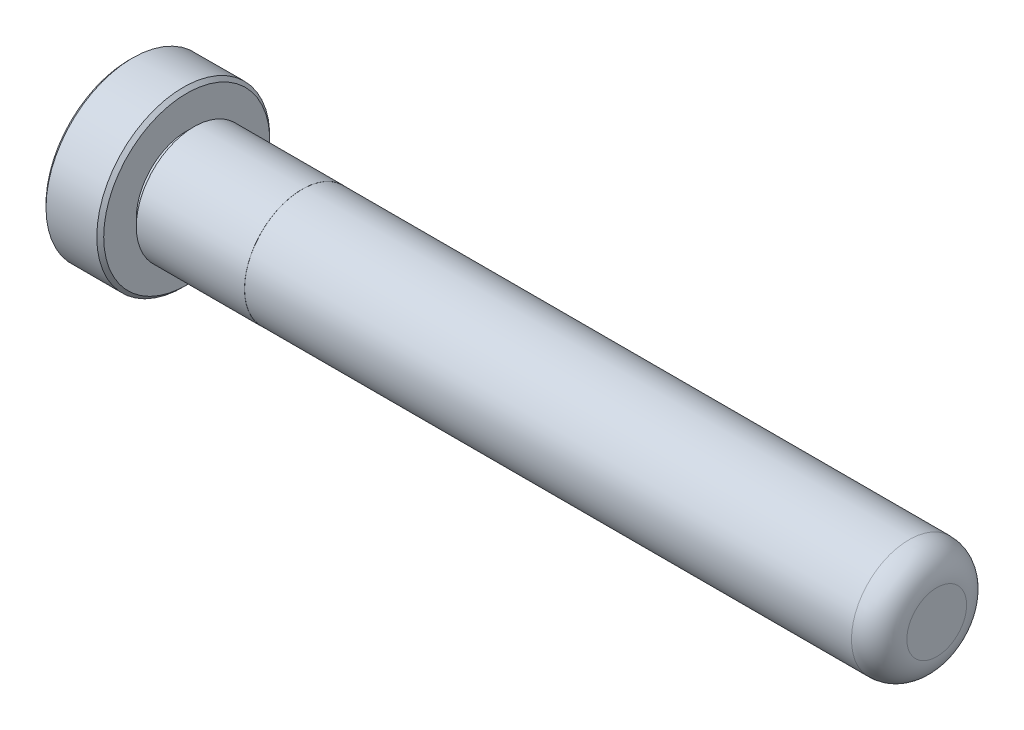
from build123d import *

# Parameters (mm, degrees)
FILLET1_R     = 3.048
CHAMFER1_SIZE = 0.381


with BuildPart() as part:
    # Sketch1 → Revolve1 (revolve)
    with BuildSketch(Plane.XY, mode=Mode.PRIVATE) as revolve1_sk:
        Polygon((0, 0), (0, 9.525), (6.35, 9.525), (6.35, 5.55625), (7.14375, 5.55625), (7.14375, 6.35), (19.05, 6.35), (19.05, 6.3373), (88.9, 6.3373), (88.9, 0), align=None)
    revolve(revolve1_sk.sketch.rotate(Axis((-40.401648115, 0, 0), (1, 0, 0)), 90), axis=Axis((-40.401648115, 0, 0), (1, 0, 0)))

    # Fillet1
    fillet1_edges = [part.edges().sort_by_distance(p)[0] for p in [
        (88.9, 0, -6.3373),
    ]]
    fillet(fillet1_edges, radius=FILLET1_R)

    # Chamfer1
    chamfer1_edges = [part.edges().sort_by_distance(p)[0] for p in [
        (6.35, 0, -9.525),
        (0, 0, -9.525),
    ]]
    chamfer(chamfer1_edges, length=CHAMFER1_SIZE)


solid = part.part
